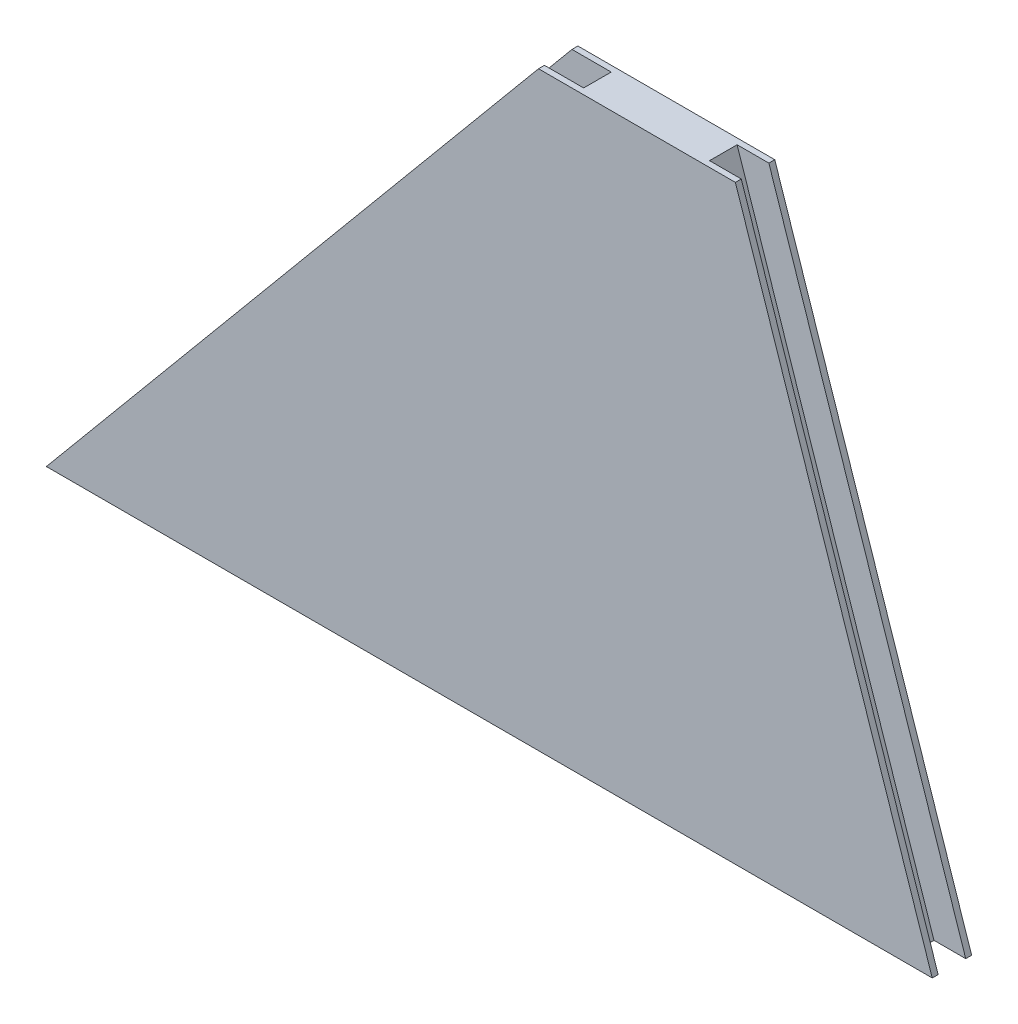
from build123d import *

# Parameters (mm, degrees)
EXTRUDE1_DEPTH     = 5.08
SKETCH8_W          = 3.556
SKETCH8_H          = 84.020975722
CUT_EXTRUDE1_DEPTH = 3.8862
SKETCH9_W          = 3.556
SKETCH9_H          = 122.920920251
CUT_EXTRUDE2_DEPTH = 3.8862


with BuildPart() as part:
    # Sketch4 → Extrude1 (new body)
    with BuildSketch(Plane.XY):
        Polygon((107.338515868, 111.154032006), (18.438515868, 111.154032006), (81.938515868, 187.354032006), (107.338515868, 187.354032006), (132.738515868, 111.154032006), align=None)
    extrude(amount=EXTRUDE1_DEPTH)

    # Sketch8 → Cut-Extrude1 (cut)
    with BuildSketch(Plane(origin=(152.810873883, 50.936957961, 0), x_dir=(0, 0, -1), z_dir=(0.9486832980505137, 0.31622776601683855, 0))):
        with Locations((-2.54, 105.090192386)):
            Rectangle(SKETCH8_W, SKETCH8_H)
    extrude(amount=-CUT_EXTRUDE1_DEPTH, mode=Mode.SUBTRACT)

    # Sketch9 → Cut-Extrude2 (cut)
    with BuildSketch(Plane(origin=(-43.78417031, 36.486808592, 0), x_dir=(0, 0, 1), z_dir=(-0.7682212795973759, 0.6401843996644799, 0))):
        with Locations((2.54, 156.710997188)):
            Rectangle(SKETCH9_W, SKETCH9_H)
    extrude(amount=-CUT_EXTRUDE2_DEPTH, mode=Mode.SUBTRACT)


solid = part.part
